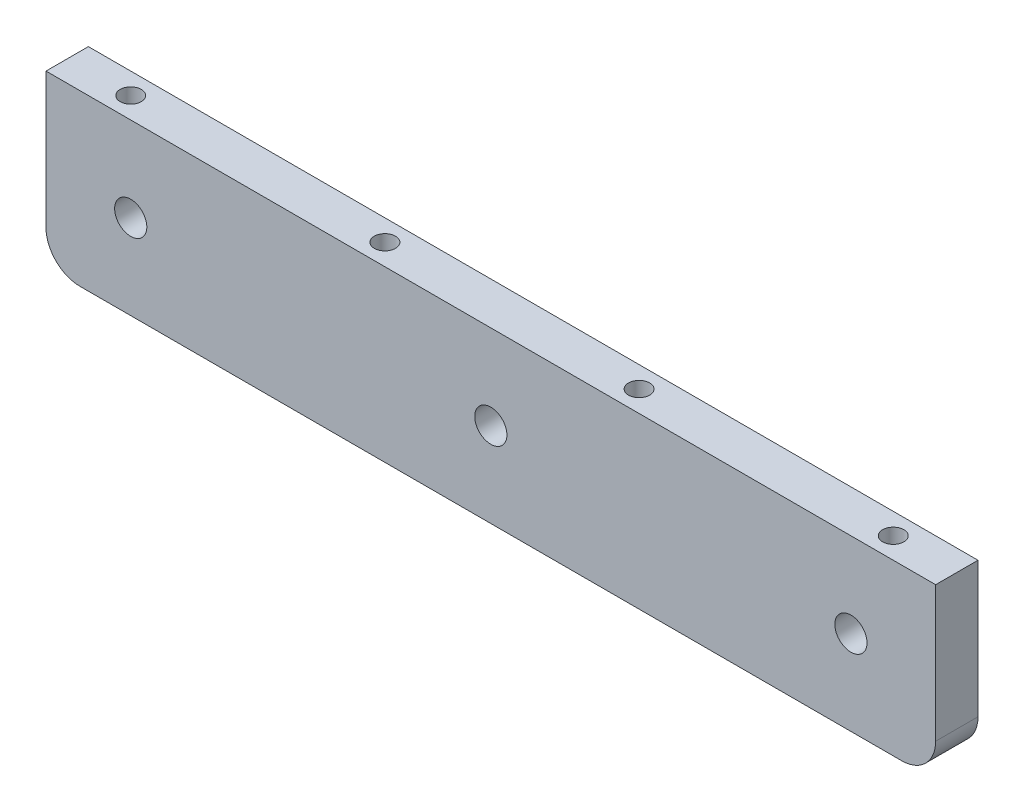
ISO-10303-21;
HEADER;
FILE_DESCRIPTION(('STEP AP214'),'2;1');
FILE_NAME('part.step','',(''),(''),'','','');
FILE_SCHEMA(('AUTOMOTIVE_DESIGN { 1 0 10303 214 1 1 1 1 }'));
ENDSEC;
DATA;
#1=APPLICATION_CONTEXT('core data for automotive mechanical design processes');
#2=APPLICATION_PROTOCOL_DEFINITION('international standard','automotive_design',2000,#1);
#3=PRODUCT_CONTEXT('',#1,'mechanical');
#4=PRODUCT('Part','Part','',(#3));
#5=PRODUCT_RELATED_PRODUCT_CATEGORY('part','',(#4));
#6=PRODUCT_DEFINITION_FORMATION('','',#4);
#7=PRODUCT_DEFINITION_CONTEXT('part definition',#1,'design');
#8=PRODUCT_DEFINITION('design','',#6,#7);
#9=PRODUCT_DEFINITION_SHAPE('','',#8);
#10=(LENGTH_UNIT() NAMED_UNIT(*) SI_UNIT(.MILLI.,.METRE.));
#11=(NAMED_UNIT(*) PLANE_ANGLE_UNIT() SI_UNIT($,.RADIAN.));
#12=(NAMED_UNIT(*) SI_UNIT($,.STERADIAN.) SOLID_ANGLE_UNIT());
#13=UNCERTAINTY_MEASURE_WITH_UNIT(LENGTH_MEASURE(1.E-05),#10,'distance_accuracy_value','');
#14=(GEOMETRIC_REPRESENTATION_CONTEXT(3) GLOBAL_UNCERTAINTY_ASSIGNED_CONTEXT((#13)) GLOBAL_UNIT_ASSIGNED_CONTEXT((#10,
#11,#12)) REPRESENTATION_CONTEXT('',''));
#15=CARTESIAN_POINT('',(0.,0.,0.));
#16=DIRECTION('',(0.,0.,1.));
#17=DIRECTION('',(1.,0.,0.));
#18=AXIS2_PLACEMENT_3D('',#15,#16,#17);
#19=CARTESIAN_POINT('',(-123.19,-40.64,6.35));
#20=DIRECTION('',(0.,0.,1.));
#21=DIRECTION('',(1.,0.,0.));
#22=AXIS2_PLACEMENT_3D('',#19,#20,#21);
#23=PLANE('',#22);
#24=CARTESIAN_POINT('',(0.,-25.4,6.35));
#25=DIRECTION('',(0.,0.,1.));
#26=DIRECTION('',(1.,0.,0.));
#27=AXIS2_PLACEMENT_3D('',#24,#25,#26);
#28=CIRCLE('',#27,4.826);
#29=CARTESIAN_POINT('',(4.826,-25.4,6.35));
#30=VERTEX_POINT('',#29);
#31=EDGE_CURVE('E255',#30,#30,#28,.T.);
#32=ORIENTED_EDGE('',*,*,#31,.F.);
#33=EDGE_LOOP('',(#32));
#34=FACE_BOUND('',#33,.T.);
#35=DIRECTION('',(0.,-1.,0.));
#36=VECTOR('',#35,1.);
#37=CARTESIAN_POINT('',(-133.35,0.,6.35));
#38=LINE('',#37,#36);
#39=CARTESIAN_POINT('',(-133.35,0.,6.35));
#40=VERTEX_POINT('',#39);
#41=CARTESIAN_POINT('',(-133.35,-40.64,6.35));
#42=VERTEX_POINT('',#41);
#43=EDGE_CURVE('E144',#40,#42,#38,.T.);
#44=ORIENTED_EDGE('',*,*,#43,.T.);
#45=CARTESIAN_POINT('',(-123.19,-40.64,6.35));
#46=DIRECTION('',(0.,0.,1.));
#47=DIRECTION('',(1.,0.,0.));
#48=AXIS2_PLACEMENT_3D('',#45,#46,#47);
#49=CIRCLE('',#48,10.16);
#50=CARTESIAN_POINT('',(-123.19,-50.8,6.35));
#51=VERTEX_POINT('',#50);
#52=EDGE_CURVE('E102',#42,#51,#49,.T.);
#53=ORIENTED_EDGE('',*,*,#52,.T.);
#54=DIRECTION('',(1.,0.,0.));
#55=VECTOR('',#54,1.);
#56=CARTESIAN_POINT('',(-123.19,-50.8,6.35));
#57=LINE('',#56,#55);
#58=CARTESIAN_POINT('',(123.19,-50.8,6.35));
#59=VERTEX_POINT('',#58);
#60=EDGE_CURVE('E115',#51,#59,#57,.T.);
#61=ORIENTED_EDGE('',*,*,#60,.T.);
#62=CARTESIAN_POINT('',(123.19,-40.64,6.35));
#63=DIRECTION('',(0.,0.,1.));
#64=DIRECTION('',(-1.,0.,0.));
#65=AXIS2_PLACEMENT_3D('',#62,#63,#64);
#66=CIRCLE('',#65,10.16);
#67=CARTESIAN_POINT('',(133.35,-40.64,6.35));
#68=VERTEX_POINT('',#67);
#69=EDGE_CURVE('E109',#59,#68,#66,.T.);
#70=ORIENTED_EDGE('',*,*,#69,.T.);
#71=DIRECTION('',(0.,1.,0.));
#72=VECTOR('',#71,1.);
#73=CARTESIAN_POINT('',(133.35,0.,6.35));
#74=LINE('',#73,#72);
#75=CARTESIAN_POINT('',(133.35,0.,6.35));
#76=VERTEX_POINT('',#75);
#77=EDGE_CURVE('E113',#68,#76,#74,.T.);
#78=ORIENTED_EDGE('',*,*,#77,.T.);
#79=DIRECTION('',(-1.,0.,0.));
#80=VECTOR('',#79,1.);
#81=CARTESIAN_POINT('',(133.35,0.,6.35));
#82=LINE('',#81,#80);
#83=EDGE_CURVE('E65',#76,#40,#82,.T.);
#84=ORIENTED_EDGE('',*,*,#83,.T.);
#85=EDGE_LOOP('',(#44,#53,#61,#70,#78,#84));
#86=FACE_BOUND('',#85,.T.);
#87=CARTESIAN_POINT('',(-107.95,-25.4,6.35));
#88=DIRECTION('',(0.,0.,1.));
#89=DIRECTION('',(1.,0.,0.));
#90=AXIS2_PLACEMENT_3D('',#87,#88,#89);
#91=CIRCLE('',#90,4.82599999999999);
#92=CARTESIAN_POINT('',(-103.124,-25.4,6.35));
#93=VERTEX_POINT('',#92);
#94=EDGE_CURVE('E137',#93,#93,#91,.T.);
#95=ORIENTED_EDGE('',*,*,#94,.F.);
#96=EDGE_LOOP('',(#95));
#97=FACE_BOUND('',#96,.T.);
#98=CARTESIAN_POINT('',(107.95,-25.4,6.35));
#99=DIRECTION('',(0.,0.,1.));
#100=DIRECTION('',(1.,0.,0.));
#101=AXIS2_PLACEMENT_3D('',#98,#99,#100);
#102=CIRCLE('',#101,4.82599999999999);
#103=CARTESIAN_POINT('',(112.776,-25.4,6.35));
#104=VERTEX_POINT('',#103);
#105=EDGE_CURVE('E249',#104,#104,#102,.T.);
#106=ORIENTED_EDGE('',*,*,#105,.F.);
#107=EDGE_LOOP('',(#106));
#108=FACE_BOUND('',#107,.T.);
#109=ADVANCED_FACE('F48',(#34,#86,#97,#108),#23,.T.);
#110=CARTESIAN_POINT('',(-123.19,-40.64,-6.35));
#111=DIRECTION('',(0.,0.,1.));
#112=DIRECTION('',(1.,0.,0.));
#113=AXIS2_PLACEMENT_3D('',#110,#111,#112);
#114=PLANE('',#113);
#115=DIRECTION('',(0.,-1.,0.));
#116=VECTOR('',#115,1.);
#117=CARTESIAN_POINT('',(-133.35,0.,-6.35));
#118=LINE('',#117,#116);
#119=CARTESIAN_POINT('',(-133.35,0.,-6.35));
#120=VERTEX_POINT('',#119);
#121=CARTESIAN_POINT('',(-133.35,-40.64,-6.35));
#122=VERTEX_POINT('',#121);
#123=EDGE_CURVE('E133',#120,#122,#118,.T.);
#124=ORIENTED_EDGE('',*,*,#123,.F.);
#125=DIRECTION('',(-1.,0.,0.));
#126=VECTOR('',#125,1.);
#127=CARTESIAN_POINT('',(133.35,0.,-6.35));
#128=LINE('',#127,#126);
#129=CARTESIAN_POINT('',(133.35,0.,-6.35));
#130=VERTEX_POINT('',#129);
#131=EDGE_CURVE('E94',#130,#120,#128,.T.);
#132=ORIENTED_EDGE('',*,*,#131,.F.);
#133=DIRECTION('',(0.,1.,0.));
#134=VECTOR('',#133,1.);
#135=CARTESIAN_POINT('',(133.35,0.,-6.35));
#136=LINE('',#135,#134);
#137=CARTESIAN_POINT('',(133.35,-40.64,-6.35));
#138=VERTEX_POINT('',#137);
#139=EDGE_CURVE('E88',#138,#130,#136,.T.);
#140=ORIENTED_EDGE('',*,*,#139,.F.);
#141=CARTESIAN_POINT('',(123.19,-40.64,-6.35));
#142=DIRECTION('',(0.,0.,1.));
#143=DIRECTION('',(-1.,0.,0.));
#144=AXIS2_PLACEMENT_3D('',#141,#142,#143);
#145=CIRCLE('',#144,10.16);
#146=CARTESIAN_POINT('',(123.19,-50.8,-6.35));
#147=VERTEX_POINT('',#146);
#148=EDGE_CURVE('E123',#147,#138,#145,.T.);
#149=ORIENTED_EDGE('',*,*,#148,.F.);
#150=DIRECTION('',(1.,0.,0.));
#151=VECTOR('',#150,1.);
#152=CARTESIAN_POINT('',(-123.19,-50.8,-6.35));
#153=LINE('',#152,#151);
#154=CARTESIAN_POINT('',(-123.19,-50.8,-6.35));
#155=VERTEX_POINT('',#154);
#156=EDGE_CURVE('E139',#155,#147,#153,.T.);
#157=ORIENTED_EDGE('',*,*,#156,.F.);
#158=CARTESIAN_POINT('',(-123.19,-40.64,-6.35));
#159=DIRECTION('',(0.,0.,1.));
#160=DIRECTION('',(1.,0.,0.));
#161=AXIS2_PLACEMENT_3D('',#158,#159,#160);
#162=CIRCLE('',#161,10.16);
#163=EDGE_CURVE('E136',#122,#155,#162,.T.);
#164=ORIENTED_EDGE('',*,*,#163,.F.);
#165=EDGE_LOOP('',(#124,#132,#140,#149,#157,#164));
#166=FACE_BOUND('',#165,.T.);
#167=CARTESIAN_POINT('',(-107.95,-25.4,-6.35));
#168=DIRECTION('',(0.,0.,1.));
#169=DIRECTION('',(1.,0.,0.));
#170=AXIS2_PLACEMENT_3D('',#167,#168,#169);
#171=CIRCLE('',#170,4.82599999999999);
#172=CARTESIAN_POINT('',(-103.124,-25.4,-6.35));
#173=VERTEX_POINT('',#172);
#174=EDGE_CURVE('E258',#173,#173,#171,.T.);
#175=ORIENTED_EDGE('',*,*,#174,.T.);
#176=EDGE_LOOP('',(#175));
#177=FACE_BOUND('',#176,.T.);
#178=CARTESIAN_POINT('',(0.,-25.4,-6.35));
#179=DIRECTION('',(0.,0.,1.));
#180=DIRECTION('',(1.,0.,0.));
#181=AXIS2_PLACEMENT_3D('',#178,#179,#180);
#182=CIRCLE('',#181,4.826);
#183=CARTESIAN_POINT('',(4.826,-25.4,-6.35));
#184=VERTEX_POINT('',#183);
#185=EDGE_CURVE('E252',#184,#184,#182,.T.);
#186=ORIENTED_EDGE('',*,*,#185,.T.);
#187=EDGE_LOOP('',(#186));
#188=FACE_BOUND('',#187,.T.);
#189=CARTESIAN_POINT('',(107.95,-25.4,-6.35));
#190=DIRECTION('',(0.,0.,1.));
#191=DIRECTION('',(1.,0.,0.));
#192=AXIS2_PLACEMENT_3D('',#189,#190,#191);
#193=CIRCLE('',#192,4.82599999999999);
#194=CARTESIAN_POINT('',(112.776,-25.4,-6.35));
#195=VERTEX_POINT('',#194);
#196=EDGE_CURVE('E247',#195,#195,#193,.T.);
#197=ORIENTED_EDGE('',*,*,#196,.T.);
#198=EDGE_LOOP('',(#197));
#199=FACE_BOUND('',#198,.T.);
#200=ADVANCED_FACE('F153',(#166,#177,#188,#199),#114,.F.);
#201=CARTESIAN_POINT('',(-133.35,0.,6.35));
#202=DIRECTION('',(1.,0.,0.));
#203=DIRECTION('',(0.,1.,0.));
#204=AXIS2_PLACEMENT_3D('',#201,#202,#203);
#205=PLANE('',#204);
#206=ORIENTED_EDGE('',*,*,#123,.T.);
#207=DIRECTION('',(0.,0.,-1.));
#208=VECTOR('',#207,1.);
#209=CARTESIAN_POINT('',(-133.35,-40.64,6.35));
#210=LINE('',#209,#208);
#211=EDGE_CURVE('E13',#42,#122,#210,.T.);
#212=ORIENTED_EDGE('',*,*,#211,.F.);
#213=ORIENTED_EDGE('',*,*,#43,.F.);
#214=DIRECTION('',(0.,0.,-1.));
#215=VECTOR('',#214,1.);
#216=CARTESIAN_POINT('',(-133.35,0.,6.35));
#217=LINE('',#216,#215);
#218=EDGE_CURVE('E129',#40,#120,#217,.T.);
#219=ORIENTED_EDGE('',*,*,#218,.T.);
#220=EDGE_LOOP('',(#206,#212,#213,#219));
#221=FACE_BOUND('',#220,.T.);
#222=ADVANCED_FACE('F50',(#221),#205,.F.);
#223=CARTESIAN_POINT('',(-123.19,-40.64,6.35));
#224=DIRECTION('',(0.,0.,-1.));
#225=DIRECTION('',(-1.,0.,0.));
#226=AXIS2_PLACEMENT_3D('',#223,#224,#225);
#227=CYLINDRICAL_SURFACE('',#226,10.16);
#228=ORIENTED_EDGE('',*,*,#163,.T.);
#229=DIRECTION('',(0.,0.,-1.));
#230=VECTOR('',#229,1.);
#231=CARTESIAN_POINT('',(-123.19,-50.8,6.35));
#232=LINE('',#231,#230);
#233=EDGE_CURVE('E57',#51,#155,#232,.T.);
#234=ORIENTED_EDGE('',*,*,#233,.F.);
#235=ORIENTED_EDGE('',*,*,#52,.F.);
#236=ORIENTED_EDGE('',*,*,#211,.T.);
#237=EDGE_LOOP('',(#228,#234,#235,#236));
#238=FACE_BOUND('',#237,.T.);
#239=ADVANCED_FACE('F353',(#238),#227,.T.);
#240=CARTESIAN_POINT('',(-123.19,-50.8,6.35));
#241=DIRECTION('',(0.,1.,0.));
#242=DIRECTION('',(0.,0.,1.));
#243=AXIS2_PLACEMENT_3D('',#240,#241,#242);
#244=PLANE('',#243);
#245=ORIENTED_EDGE('',*,*,#156,.T.);
#246=DIRECTION('',(0.,0.,-1.));
#247=VECTOR('',#246,1.);
#248=CARTESIAN_POINT('',(123.19,-50.8,6.35));
#249=LINE('',#248,#247);
#250=EDGE_CURVE('E124',#59,#147,#249,.T.);
#251=ORIENTED_EDGE('',*,*,#250,.F.);
#252=ORIENTED_EDGE('',*,*,#60,.F.);
#253=ORIENTED_EDGE('',*,*,#233,.T.);
#254=EDGE_LOOP('',(#245,#251,#252,#253));
#255=FACE_BOUND('',#254,.T.);
#256=ADVANCED_FACE('F150',(#255),#244,.F.);
#257=CARTESIAN_POINT('',(123.19,-40.64,6.35));
#258=DIRECTION('',(0.,0.,-1.));
#259=DIRECTION('',(-1.,0.,0.));
#260=AXIS2_PLACEMENT_3D('',#257,#258,#259);
#261=CYLINDRICAL_SURFACE('',#260,10.16);
#262=ORIENTED_EDGE('',*,*,#148,.T.);
#263=DIRECTION('',(0.,0.,-1.));
#264=VECTOR('',#263,1.);
#265=CARTESIAN_POINT('',(133.35,-40.64,6.35));
#266=LINE('',#265,#264);
#267=EDGE_CURVE('E120',#68,#138,#266,.T.);
#268=ORIENTED_EDGE('',*,*,#267,.F.);
#269=ORIENTED_EDGE('',*,*,#69,.F.);
#270=ORIENTED_EDGE('',*,*,#250,.T.);
#271=EDGE_LOOP('',(#262,#268,#269,#270));
#272=FACE_BOUND('',#271,.T.);
#273=ADVANCED_FACE('F121',(#272),#261,.T.);
#274=CARTESIAN_POINT('',(133.35,0.,6.35));
#275=DIRECTION('',(-1.,0.,0.));
#276=DIRECTION('',(0.,-1.,0.));
#277=AXIS2_PLACEMENT_3D('',#274,#275,#276);
#278=PLANE('',#277);
#279=ORIENTED_EDGE('',*,*,#139,.T.);
#280=DIRECTION('',(0.,0.,-1.));
#281=VECTOR('',#280,1.);
#282=CARTESIAN_POINT('',(133.35,0.,6.35));
#283=LINE('',#282,#281);
#284=EDGE_CURVE('E125',#76,#130,#283,.T.);
#285=ORIENTED_EDGE('',*,*,#284,.F.);
#286=ORIENTED_EDGE('',*,*,#77,.F.);
#287=ORIENTED_EDGE('',*,*,#267,.T.);
#288=EDGE_LOOP('',(#279,#285,#286,#287));
#289=FACE_BOUND('',#288,.T.);
#290=ADVANCED_FACE('F127',(#289),#278,.F.);
#291=CARTESIAN_POINT('',(133.35,0.,6.35));
#292=DIRECTION('',(0.,-1.,0.));
#293=DIRECTION('',(0.,0.,-1.));
#294=AXIS2_PLACEMENT_3D('',#291,#292,#293);
#295=PLANE('',#294);
#296=CARTESIAN_POINT('',(38.1,0.,0.));
#297=DIRECTION('',(0.,1.,0.));
#298=DIRECTION('',(0.,0.,1.));
#299=AXIS2_PLACEMENT_3D('',#296,#297,#298);
#300=CIRCLE('',#299,3.175);
#301=CARTESIAN_POINT('',(38.1,0.,3.175));
#302=VERTEX_POINT('',#301);
#303=EDGE_CURVE('E226',#302,#302,#300,.T.);
#304=ORIENTED_EDGE('',*,*,#303,.F.);
#305=EDGE_LOOP('',(#304));
#306=FACE_BOUND('',#305,.T.);
#307=CARTESIAN_POINT('',(-38.1,0.,2.22044604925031E-13));
#308=DIRECTION('',(0.,1.,0.));
#309=DIRECTION('',(0.,0.,-1.));
#310=AXIS2_PLACEMENT_3D('',#307,#308,#309);
#311=CIRCLE('',#310,3.17499999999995);
#312=CARTESIAN_POINT('',(-38.1,0.,3.17500000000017));
#313=VERTEX_POINT('',#312);
#314=EDGE_CURVE('E237',#313,#313,#311,.T.);
#315=ORIENTED_EDGE('',*,*,#314,.F.);
#316=EDGE_LOOP('',(#315));
#317=FACE_BOUND('',#316,.T.);
#318=CARTESIAN_POINT('',(-114.3,0.,8.88178419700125E-13));
#319=DIRECTION('',(0.,1.,0.));
#320=DIRECTION('',(0.,0.,-1.));
#321=AXIS2_PLACEMENT_3D('',#318,#319,#320);
#322=CIRCLE('',#321,3.175);
#323=CARTESIAN_POINT('',(-114.3,0.,3.17500000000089));
#324=VERTEX_POINT('',#323);
#325=EDGE_CURVE('E243',#324,#324,#322,.T.);
#326=ORIENTED_EDGE('',*,*,#325,.F.);
#327=EDGE_LOOP('',(#326));
#328=FACE_BOUND('',#327,.T.);
#329=CARTESIAN_POINT('',(114.3,0.,0.));
#330=DIRECTION('',(0.,1.,0.));
#331=DIRECTION('',(0.,0.,1.));
#332=AXIS2_PLACEMENT_3D('',#329,#330,#331);
#333=CIRCLE('',#332,3.175);
#334=CARTESIAN_POINT('',(114.3,0.,3.175));
#335=VERTEX_POINT('',#334);
#336=EDGE_CURVE('E225',#335,#335,#333,.T.);
#337=ORIENTED_EDGE('',*,*,#336,.F.);
#338=EDGE_LOOP('',(#337));
#339=FACE_BOUND('',#338,.T.);
#340=ORIENTED_EDGE('',*,*,#131,.T.);
#341=ORIENTED_EDGE('',*,*,#218,.F.);
#342=ORIENTED_EDGE('',*,*,#83,.F.);
#343=ORIENTED_EDGE('',*,*,#284,.T.);
#344=EDGE_LOOP('',(#340,#341,#342,#343));
#345=FACE_BOUND('',#344,.T.);
#346=ADVANCED_FACE('F158',(#306,#317,#328,#339,#345),#295,.F.);
#347=CARTESIAN_POINT('',(-107.95,-25.4,6.35));
#348=DIRECTION('',(0.,0.,-1.));
#349=DIRECTION('',(-1.,0.,0.));
#350=AXIS2_PLACEMENT_3D('',#347,#348,#349);
#351=CYLINDRICAL_SURFACE('',#350,4.82599999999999);
#352=ORIENTED_EDGE('',*,*,#94,.T.);
#353=EDGE_LOOP('',(#352));
#354=FACE_BOUND('',#353,.T.);
#355=ORIENTED_EDGE('',*,*,#174,.F.);
#356=EDGE_LOOP('',(#355));
#357=FACE_BOUND('',#356,.T.);
#358=ADVANCED_FACE('F160',(#354,#357),#351,.F.);
#359=CARTESIAN_POINT('',(0.,-25.4,6.35));
#360=DIRECTION('',(0.,0.,-1.));
#361=DIRECTION('',(-1.,0.,0.));
#362=AXIS2_PLACEMENT_3D('',#359,#360,#361);
#363=CYLINDRICAL_SURFACE('',#362,4.826);
#364=ORIENTED_EDGE('',*,*,#31,.T.);
#365=EDGE_LOOP('',(#364));
#366=FACE_BOUND('',#365,.T.);
#367=ORIENTED_EDGE('',*,*,#185,.F.);
#368=EDGE_LOOP('',(#367));
#369=FACE_BOUND('',#368,.T.);
#370=ADVANCED_FACE('F167',(#366,#369),#363,.F.);
#371=CARTESIAN_POINT('',(107.95,-25.4,6.35));
#372=DIRECTION('',(0.,0.,-1.));
#373=DIRECTION('',(-1.,0.,0.));
#374=AXIS2_PLACEMENT_3D('',#371,#372,#373);
#375=CYLINDRICAL_SURFACE('',#374,4.82599999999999);
#376=ORIENTED_EDGE('',*,*,#105,.T.);
#377=EDGE_LOOP('',(#376));
#378=FACE_BOUND('',#377,.T.);
#379=ORIENTED_EDGE('',*,*,#196,.F.);
#380=EDGE_LOOP('',(#379));
#381=FACE_BOUND('',#380,.T.);
#382=ADVANCED_FACE('F184',(#378,#381),#375,.F.);
#383=CARTESIAN_POINT('',(114.3,-19.05,0.));
#384=DIRECTION('',(0.,1.,0.));
#385=DIRECTION('',(0.,0.,1.));
#386=AXIS2_PLACEMENT_3D('',#383,#384,#385);
#387=CYLINDRICAL_SURFACE('',#386,3.175);
#388=CARTESIAN_POINT('',(114.3,-19.05,0.));
#389=DIRECTION('',(0.,1.,0.));
#390=DIRECTION('',(0.,0.,1.));
#391=AXIS2_PLACEMENT_3D('',#388,#389,#390);
#392=CIRCLE('',#391,3.175);
#393=CARTESIAN_POINT('',(114.3,-19.05,3.175));
#394=VERTEX_POINT('',#393);
#395=EDGE_CURVE('E229',#394,#394,#392,.T.);
#396=CARTESIAN_POINT('',(114.3,-19.05,3.175));
#397=CARTESIAN_POINT('',(114.3,-18.8515625,3.175));
#398=CARTESIAN_POINT('',(114.3,-18.653125,3.175));
#399=CARTESIAN_POINT('',(114.3,-18.25625,3.175));
#400=CARTESIAN_POINT('',(114.3,-18.0578125,3.175));
#401=CARTESIAN_POINT('',(114.3,-17.6609375,3.175));
#402=CARTESIAN_POINT('',(114.3,-17.4625,3.175));
#403=CARTESIAN_POINT('',(114.3,-17.065625,3.175));
#404=CARTESIAN_POINT('',(114.3,-16.8671875,3.175));
#405=CARTESIAN_POINT('',(114.3,-16.4703125,3.175));
#406=CARTESIAN_POINT('',(114.3,-16.271875,3.175));
#407=CARTESIAN_POINT('',(114.3,-15.875,3.175));
#408=CARTESIAN_POINT('',(114.3,-15.6765625,3.175));
#409=CARTESIAN_POINT('',(114.3,-15.2796875,3.175));
#410=CARTESIAN_POINT('',(114.3,-15.08125,3.175));
#411=CARTESIAN_POINT('',(114.3,-14.684375,3.175));
#412=CARTESIAN_POINT('',(114.3,-14.4859375,3.175));
#413=CARTESIAN_POINT('',(114.3,-14.0890625,3.175));
#414=CARTESIAN_POINT('',(114.3,-13.890625,3.175));
#415=CARTESIAN_POINT('',(114.3,-13.49375,3.175));
#416=CARTESIAN_POINT('',(114.3,-13.2953125,3.175));
#417=CARTESIAN_POINT('',(114.3,-12.8984375,3.175));
#418=CARTESIAN_POINT('',(114.3,-12.7,3.175));
#419=CARTESIAN_POINT('',(114.3,-12.303125,3.175));
#420=CARTESIAN_POINT('',(114.3,-12.1046875,3.175));
#421=CARTESIAN_POINT('',(114.3,-11.7078125,3.175));
#422=CARTESIAN_POINT('',(114.3,-11.509375,3.175));
#423=CARTESIAN_POINT('',(114.3,-11.1125,3.175));
#424=CARTESIAN_POINT('',(114.3,-10.9140625,3.175));
#425=CARTESIAN_POINT('',(114.3,-10.5171875,3.175));
#426=CARTESIAN_POINT('',(114.3,-10.31875,3.175));
#427=CARTESIAN_POINT('',(114.3,-9.921875,3.175));
#428=CARTESIAN_POINT('',(114.3,-9.7234375,3.175));
#429=CARTESIAN_POINT('',(114.3,-9.3265625,3.175));
#430=CARTESIAN_POINT('',(114.3,-9.128125,3.175));
#431=CARTESIAN_POINT('',(114.3,-8.73125,3.175));
#432=CARTESIAN_POINT('',(114.3,-8.5328125,3.175));
#433=CARTESIAN_POINT('',(114.3,-8.1359375,3.175));
#434=CARTESIAN_POINT('',(114.3,-7.9375,3.175));
#435=CARTESIAN_POINT('',(114.3,-7.540625,3.175));
#436=CARTESIAN_POINT('',(114.3,-7.3421875,3.175));
#437=CARTESIAN_POINT('',(114.3,-6.9453125,3.175));
#438=CARTESIAN_POINT('',(114.3,-6.746875,3.175));
#439=CARTESIAN_POINT('',(114.3,-6.35,3.175));
#440=CARTESIAN_POINT('',(114.3,-6.1515625,3.175));
#441=CARTESIAN_POINT('',(114.3,-5.7546875,3.175));
#442=CARTESIAN_POINT('',(114.3,-5.55625,3.175));
#443=CARTESIAN_POINT('',(114.3,-5.159375,3.175));
#444=CARTESIAN_POINT('',(114.3,-4.9609375,3.175));
#445=CARTESIAN_POINT('',(114.3,-4.5640625,3.175));
#446=CARTESIAN_POINT('',(114.3,-4.365625,3.175));
#447=CARTESIAN_POINT('',(114.3,-3.96875,3.175));
#448=CARTESIAN_POINT('',(114.3,-3.7703125,3.175));
#449=CARTESIAN_POINT('',(114.3,-3.3734375,3.175));
#450=CARTESIAN_POINT('',(114.3,-3.175,3.175));
#451=CARTESIAN_POINT('',(114.3,-2.778125,3.175));
#452=CARTESIAN_POINT('',(114.3,-2.5796875,3.175));
#453=CARTESIAN_POINT('',(114.3,-2.1828125,3.175));
#454=CARTESIAN_POINT('',(114.3,-1.984375,3.175));
#455=CARTESIAN_POINT('',(114.3,-1.5875,3.175));
#456=CARTESIAN_POINT('',(114.3,-1.3890625,3.175));
#457=CARTESIAN_POINT('',(114.3,-0.992187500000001,3.175));
#458=CARTESIAN_POINT('',(114.3,-0.793750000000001,3.175));
#459=CARTESIAN_POINT('',(114.3,-0.396875,3.175));
#460=CARTESIAN_POINT('',(114.3,-0.1984375,3.175));
#461=CARTESIAN_POINT('',(114.3,0.,3.175));
#462=B_SPLINE_CURVE_WITH_KNOTS('',3,(#396,#397,#398,#399,#400,#401,#402,#403,#404,#405,#406,
#407,#408,#409,#410,#411,#412,#413,#414,#415,#416,#417,#418,#419,#420,#421,#422,#423,#424,#425,
#426,#427,#428,#429,#430,#431,#432,#433,#434,#435,#436,#437,#438,#439,#440,#441,#442,#443,#444,
#445,#446,#447,#448,#449,#450,#451,#452,#453,#454,#455,#456,#457,#458,#459,#460,#461),
.UNSPECIFIED.,.F.,.F.,(4,2,2,2,2,2,2,2,2,2,2,2,2,2,2,2,2,2,2,2,2,2,2,2,2,2,2,2,2,2,2,2,4),(0.,
0.5953125,1.190625,1.7859375,2.38125,2.9765625,3.571875,4.1671875,4.7625,5.3578125,5.953125,
6.5484375,7.14375,7.7390625,8.334375,8.9296875,9.525,10.1203125,10.715625,11.3109375,11.90625,
12.5015625,13.096875,13.6921875,14.2875,14.8828125,15.478125,16.0734375,16.66875,17.2640625,
17.859375,18.4546875,19.05),.UNSPECIFIED.);
#463=EDGE_CURVE('BSEAM188',#394,#335,#462,.T.);
#464=ORIENTED_EDGE('',*,*,#395,.F.);
#465=ORIENTED_EDGE('',*,*,#336,.T.);
#466=ORIENTED_EDGE('',*,*,#463,.T.);
#467=ORIENTED_EDGE('',*,*,#463,.F.);
#468=EDGE_LOOP('',(#464,#466,#465,#467));
#469=FACE_BOUND('',#468,.T.);
#470=ADVANCED_FACE('F188',(#469),#387,.F.);
#471=CARTESIAN_POINT('',(114.3,-19.05,0.));
#472=DIRECTION('',(0.,1.,0.));
#473=DIRECTION('',(0.,0.,1.));
#474=AXIS2_PLACEMENT_3D('',#471,#472,#473);
#475=PLANE('',#474);
#476=ORIENTED_EDGE('',*,*,#395,.T.);
#477=EDGE_LOOP('',(#476));
#478=FACE_BOUND('',#477,.T.);
#479=ADVANCED_FACE('F192',(#478),#475,.T.);
#480=CARTESIAN_POINT('',(-114.3,-19.05,8.88178419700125E-13));
#481=DIRECTION('',(0.,1.,0.));
#482=DIRECTION('',(0.,0.,1.));
#483=AXIS2_PLACEMENT_3D('',#480,#481,#482);
#484=CYLINDRICAL_SURFACE('',#483,3.175);
#485=CARTESIAN_POINT('',(-114.3,-19.05,8.88178419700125E-13));
#486=DIRECTION('',(0.,1.,0.));
#487=DIRECTION('',(0.,0.,-1.));
#488=AXIS2_PLACEMENT_3D('',#485,#486,#487);
#489=CIRCLE('',#488,3.175);
#490=CARTESIAN_POINT('',(-114.3,-19.05,3.17500000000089));
#491=VERTEX_POINT('',#490);
#492=EDGE_CURVE('E240',#491,#491,#489,.T.);
#493=CARTESIAN_POINT('',(-114.3,-19.05,3.17500000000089));
#494=CARTESIAN_POINT('',(-114.3,-18.8515625,3.17500000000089));
#495=CARTESIAN_POINT('',(-114.3,-18.653125,3.17500000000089));
#496=CARTESIAN_POINT('',(-114.3,-18.25625,3.17500000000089));
#497=CARTESIAN_POINT('',(-114.3,-18.0578125,3.17500000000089));
#498=CARTESIAN_POINT('',(-114.3,-17.6609375,3.17500000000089));
#499=CARTESIAN_POINT('',(-114.3,-17.4625,3.17500000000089));
#500=CARTESIAN_POINT('',(-114.3,-17.065625,3.17500000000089));
#501=CARTESIAN_POINT('',(-114.3,-16.8671875,3.17500000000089));
#502=CARTESIAN_POINT('',(-114.3,-16.4703125,3.17500000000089));
#503=CARTESIAN_POINT('',(-114.3,-16.271875,3.17500000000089));
#504=CARTESIAN_POINT('',(-114.3,-15.875,3.17500000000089));
#505=CARTESIAN_POINT('',(-114.3,-15.6765625,3.17500000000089));
#506=CARTESIAN_POINT('',(-114.3,-15.2796875,3.17500000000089));
#507=CARTESIAN_POINT('',(-114.3,-15.08125,3.17500000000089));
#508=CARTESIAN_POINT('',(-114.3,-14.684375,3.17500000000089));
#509=CARTESIAN_POINT('',(-114.3,-14.4859375,3.17500000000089));
#510=CARTESIAN_POINT('',(-114.3,-14.0890625,3.17500000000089));
#511=CARTESIAN_POINT('',(-114.3,-13.890625,3.17500000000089));
#512=CARTESIAN_POINT('',(-114.3,-13.49375,3.17500000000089));
#513=CARTESIAN_POINT('',(-114.3,-13.2953125,3.17500000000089));
#514=CARTESIAN_POINT('',(-114.3,-12.8984375,3.17500000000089));
#515=CARTESIAN_POINT('',(-114.3,-12.7,3.17500000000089));
#516=CARTESIAN_POINT('',(-114.3,-12.303125,3.17500000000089));
#517=CARTESIAN_POINT('',(-114.3,-12.1046875,3.17500000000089));
#518=CARTESIAN_POINT('',(-114.3,-11.7078125,3.17500000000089));
#519=CARTESIAN_POINT('',(-114.3,-11.509375,3.17500000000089));
#520=CARTESIAN_POINT('',(-114.3,-11.1125,3.17500000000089));
#521=CARTESIAN_POINT('',(-114.3,-10.9140625,3.17500000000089));
#522=CARTESIAN_POINT('',(-114.3,-10.5171875,3.17500000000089));
#523=CARTESIAN_POINT('',(-114.3,-10.31875,3.17500000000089));
#524=CARTESIAN_POINT('',(-114.3,-9.921875,3.17500000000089));
#525=CARTESIAN_POINT('',(-114.3,-9.7234375,3.17500000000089));
#526=CARTESIAN_POINT('',(-114.3,-9.3265625,3.17500000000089));
#527=CARTESIAN_POINT('',(-114.3,-9.128125,3.17500000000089));
#528=CARTESIAN_POINT('',(-114.3,-8.73125,3.17500000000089));
#529=CARTESIAN_POINT('',(-114.3,-8.5328125,3.17500000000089));
#530=CARTESIAN_POINT('',(-114.3,-8.1359375,3.17500000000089));
#531=CARTESIAN_POINT('',(-114.3,-7.9375,3.17500000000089));
#532=CARTESIAN_POINT('',(-114.3,-7.540625,3.17500000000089));
#533=CARTESIAN_POINT('',(-114.3,-7.3421875,3.17500000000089));
#534=CARTESIAN_POINT('',(-114.3,-6.9453125,3.17500000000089));
#535=CARTESIAN_POINT('',(-114.3,-6.746875,3.17500000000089));
#536=CARTESIAN_POINT('',(-114.3,-6.35,3.17500000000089));
#537=CARTESIAN_POINT('',(-114.3,-6.1515625,3.17500000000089));
#538=CARTESIAN_POINT('',(-114.3,-5.7546875,3.17500000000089));
#539=CARTESIAN_POINT('',(-114.3,-5.55625,3.17500000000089));
#540=CARTESIAN_POINT('',(-114.3,-5.159375,3.17500000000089));
#541=CARTESIAN_POINT('',(-114.3,-4.9609375,3.17500000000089));
#542=CARTESIAN_POINT('',(-114.3,-4.5640625,3.17500000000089));
#543=CARTESIAN_POINT('',(-114.3,-4.365625,3.17500000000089));
#544=CARTESIAN_POINT('',(-114.3,-3.96875,3.17500000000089));
#545=CARTESIAN_POINT('',(-114.3,-3.7703125,3.17500000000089));
#546=CARTESIAN_POINT('',(-114.3,-3.3734375,3.17500000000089));
#547=CARTESIAN_POINT('',(-114.3,-3.175,3.17500000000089));
#548=CARTESIAN_POINT('',(-114.3,-2.778125,3.17500000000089));
#549=CARTESIAN_POINT('',(-114.3,-2.5796875,3.17500000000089));
#550=CARTESIAN_POINT('',(-114.3,-2.1828125,3.17500000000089));
#551=CARTESIAN_POINT('',(-114.3,-1.984375,3.17500000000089));
#552=CARTESIAN_POINT('',(-114.3,-1.5875,3.17500000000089));
#553=CARTESIAN_POINT('',(-114.3,-1.3890625,3.17500000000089));
#554=CARTESIAN_POINT('',(-114.3,-0.992187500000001,3.17500000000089));
#555=CARTESIAN_POINT('',(-114.3,-0.793750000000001,3.17500000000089));
#556=CARTESIAN_POINT('',(-114.3,-0.396875,3.17500000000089));
#557=CARTESIAN_POINT('',(-114.3,-0.1984375,3.17500000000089));
#558=CARTESIAN_POINT('',(-114.3,0.,3.17500000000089));
#559=B_SPLINE_CURVE_WITH_KNOTS('',3,(#493,#494,#495,#496,#497,#498,#499,#500,#501,#502,#503,
#504,#505,#506,#507,#508,#509,#510,#511,#512,#513,#514,#515,#516,#517,#518,#519,#520,#521,#522,
#523,#524,#525,#526,#527,#528,#529,#530,#531,#532,#533,#534,#535,#536,#537,#538,#539,#540,#541,
#542,#543,#544,#545,#546,#547,#548,#549,#550,#551,#552,#553,#554,#555,#556,#557,#558),
.UNSPECIFIED.,.F.,.F.,(4,2,2,2,2,2,2,2,2,2,2,2,2,2,2,2,2,2,2,2,2,2,2,2,2,2,2,2,2,2,2,2,4),(0.,
0.5953125,1.190625,1.7859375,2.38125,2.9765625,3.571875,4.1671875,4.7625,5.3578125,5.953125,
6.5484375,7.14375,7.7390625,8.334375,8.9296875,9.525,10.1203125,10.715625,11.3109375,11.90625,
12.5015625,13.096875,13.6921875,14.2875,14.8828125,15.478125,16.0734375,16.66875,17.2640625,
17.859375,18.4546875,19.05),.UNSPECIFIED.);
#560=EDGE_CURVE('BSEAM196',#491,#324,#559,.T.);
#561=ORIENTED_EDGE('',*,*,#492,.F.);
#562=ORIENTED_EDGE('',*,*,#325,.T.);
#563=ORIENTED_EDGE('',*,*,#560,.T.);
#564=ORIENTED_EDGE('',*,*,#560,.F.);
#565=EDGE_LOOP('',(#561,#563,#562,#564));
#566=FACE_BOUND('',#565,.T.);
#567=ADVANCED_FACE('F196',(#566),#484,.F.);
#568=CARTESIAN_POINT('',(-114.3,-19.05,8.88178419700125E-13));
#569=DIRECTION('',(0.,-1.,0.));
#570=DIRECTION('',(0.,0.,-1.));
#571=AXIS2_PLACEMENT_3D('',#568,#569,#570);
#572=PLANE('',#571);
#573=ORIENTED_EDGE('',*,*,#492,.T.);
#574=EDGE_LOOP('',(#573));
#575=FACE_BOUND('',#574,.T.);
#576=ADVANCED_FACE('F200',(#575),#572,.F.);
#577=CARTESIAN_POINT('',(-38.1,-19.05,2.22044604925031E-13));
#578=DIRECTION('',(0.,1.,0.));
#579=DIRECTION('',(0.,0.,1.));
#580=AXIS2_PLACEMENT_3D('',#577,#578,#579);
#581=CYLINDRICAL_SURFACE('',#580,3.17499999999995);
#582=CARTESIAN_POINT('',(-38.1,-19.05,2.22044604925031E-13));
#583=DIRECTION('',(0.,1.,0.));
#584=DIRECTION('',(0.,0.,-1.));
#585=AXIS2_PLACEMENT_3D('',#582,#583,#584);
#586=CIRCLE('',#585,3.17499999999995);
#587=CARTESIAN_POINT('',(-38.1,-19.05,3.17500000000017));
#588=VERTEX_POINT('',#587);
#589=EDGE_CURVE('E232',#588,#588,#586,.T.);
#590=CARTESIAN_POINT('',(-38.1,-19.05,3.17500000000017));
#591=CARTESIAN_POINT('',(-38.1,-18.8515625,3.17500000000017));
#592=CARTESIAN_POINT('',(-38.1,-18.653125,3.17500000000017));
#593=CARTESIAN_POINT('',(-38.1,-18.25625,3.17500000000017));
#594=CARTESIAN_POINT('',(-38.1,-18.0578125,3.17500000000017));
#595=CARTESIAN_POINT('',(-38.1,-17.6609375,3.17500000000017));
#596=CARTESIAN_POINT('',(-38.1,-17.4625,3.17500000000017));
#597=CARTESIAN_POINT('',(-38.1,-17.065625,3.17500000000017));
#598=CARTESIAN_POINT('',(-38.1,-16.8671875,3.17500000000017));
#599=CARTESIAN_POINT('',(-38.1,-16.4703125,3.17500000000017));
#600=CARTESIAN_POINT('',(-38.1,-16.271875,3.17500000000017));
#601=CARTESIAN_POINT('',(-38.1,-15.875,3.17500000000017));
#602=CARTESIAN_POINT('',(-38.1,-15.6765625,3.17500000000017));
#603=CARTESIAN_POINT('',(-38.1,-15.2796875,3.17500000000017));
#604=CARTESIAN_POINT('',(-38.1,-15.08125,3.17500000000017));
#605=CARTESIAN_POINT('',(-38.1,-14.684375,3.17500000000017));
#606=CARTESIAN_POINT('',(-38.1,-14.4859375,3.17500000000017));
#607=CARTESIAN_POINT('',(-38.1,-14.0890625,3.17500000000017));
#608=CARTESIAN_POINT('',(-38.1,-13.890625,3.17500000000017));
#609=CARTESIAN_POINT('',(-38.1,-13.49375,3.17500000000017));
#610=CARTESIAN_POINT('',(-38.1,-13.2953125,3.17500000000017));
#611=CARTESIAN_POINT('',(-38.1,-12.8984375,3.17500000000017));
#612=CARTESIAN_POINT('',(-38.1,-12.7,3.17500000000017));
#613=CARTESIAN_POINT('',(-38.1,-12.303125,3.17500000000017));
#614=CARTESIAN_POINT('',(-38.1,-12.1046875,3.17500000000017));
#615=CARTESIAN_POINT('',(-38.1,-11.7078125,3.17500000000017));
#616=CARTESIAN_POINT('',(-38.1,-11.509375,3.17500000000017));
#617=CARTESIAN_POINT('',(-38.1,-11.1125,3.17500000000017));
#618=CARTESIAN_POINT('',(-38.1,-10.9140625,3.17500000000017));
#619=CARTESIAN_POINT('',(-38.1,-10.5171875,3.17500000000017));
#620=CARTESIAN_POINT('',(-38.1,-10.31875,3.17500000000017));
#621=CARTESIAN_POINT('',(-38.1,-9.921875,3.17500000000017));
#622=CARTESIAN_POINT('',(-38.1,-9.7234375,3.17500000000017));
#623=CARTESIAN_POINT('',(-38.1,-9.3265625,3.17500000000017));
#624=CARTESIAN_POINT('',(-38.1,-9.128125,3.17500000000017));
#625=CARTESIAN_POINT('',(-38.1,-8.73125,3.17500000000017));
#626=CARTESIAN_POINT('',(-38.1,-8.5328125,3.17500000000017));
#627=CARTESIAN_POINT('',(-38.1,-8.1359375,3.17500000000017));
#628=CARTESIAN_POINT('',(-38.1,-7.9375,3.17500000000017));
#629=CARTESIAN_POINT('',(-38.1,-7.540625,3.17500000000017));
#630=CARTESIAN_POINT('',(-38.1,-7.3421875,3.17500000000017));
#631=CARTESIAN_POINT('',(-38.1,-6.9453125,3.17500000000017));
#632=CARTESIAN_POINT('',(-38.1,-6.746875,3.17500000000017));
#633=CARTESIAN_POINT('',(-38.1,-6.35,3.17500000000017));
#634=CARTESIAN_POINT('',(-38.1,-6.1515625,3.17500000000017));
#635=CARTESIAN_POINT('',(-38.1,-5.7546875,3.17500000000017));
#636=CARTESIAN_POINT('',(-38.1,-5.55625,3.17500000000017));
#637=CARTESIAN_POINT('',(-38.1,-5.159375,3.17500000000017));
#638=CARTESIAN_POINT('',(-38.1,-4.9609375,3.17500000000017));
#639=CARTESIAN_POINT('',(-38.1,-4.5640625,3.17500000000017));
#640=CARTESIAN_POINT('',(-38.1,-4.365625,3.17500000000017));
#641=CARTESIAN_POINT('',(-38.1,-3.96875,3.17500000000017));
#642=CARTESIAN_POINT('',(-38.1,-3.7703125,3.17500000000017));
#643=CARTESIAN_POINT('',(-38.1,-3.3734375,3.17500000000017));
#644=CARTESIAN_POINT('',(-38.1,-3.175,3.17500000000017));
#645=CARTESIAN_POINT('',(-38.1,-2.778125,3.17500000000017));
#646=CARTESIAN_POINT('',(-38.1,-2.5796875,3.17500000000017));
#647=CARTESIAN_POINT('',(-38.1,-2.1828125,3.17500000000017));
#648=CARTESIAN_POINT('',(-38.1,-1.984375,3.17500000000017));
#649=CARTESIAN_POINT('',(-38.1,-1.5875,3.17500000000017));
#650=CARTESIAN_POINT('',(-38.1,-1.3890625,3.17500000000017));
#651=CARTESIAN_POINT('',(-38.1,-0.992187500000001,3.17500000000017));
#652=CARTESIAN_POINT('',(-38.1,-0.793750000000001,3.17500000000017));
#653=CARTESIAN_POINT('',(-38.1,-0.396875,3.17500000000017));
#654=CARTESIAN_POINT('',(-38.1,-0.1984375,3.17500000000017));
#655=CARTESIAN_POINT('',(-38.1,0.,3.17500000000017));
#656=B_SPLINE_CURVE_WITH_KNOTS('',3,(#590,#591,#592,#593,#594,#595,#596,#597,#598,#599,#600,
#601,#602,#603,#604,#605,#606,#607,#608,#609,#610,#611,#612,#613,#614,#615,#616,#617,#618,#619,
#620,#621,#622,#623,#624,#625,#626,#627,#628,#629,#630,#631,#632,#633,#634,#635,#636,#637,#638,
#639,#640,#641,#642,#643,#644,#645,#646,#647,#648,#649,#650,#651,#652,#653,#654,#655),
.UNSPECIFIED.,.F.,.F.,(4,2,2,2,2,2,2,2,2,2,2,2,2,2,2,2,2,2,2,2,2,2,2,2,2,2,2,2,2,2,2,2,4),(0.,
0.5953125,1.190625,1.7859375,2.38125,2.9765625,3.571875,4.1671875,4.7625,5.3578125,5.953125,
6.5484375,7.14375,7.7390625,8.334375,8.9296875,9.525,10.1203125,10.715625,11.3109375,11.90625,
12.5015625,13.096875,13.6921875,14.2875,14.8828125,15.478125,16.0734375,16.66875,17.2640625,
17.859375,18.4546875,19.05),.UNSPECIFIED.);
#657=EDGE_CURVE('BSEAM204',#588,#313,#656,.T.);
#658=ORIENTED_EDGE('',*,*,#589,.F.);
#659=ORIENTED_EDGE('',*,*,#314,.T.);
#660=ORIENTED_EDGE('',*,*,#657,.T.);
#661=ORIENTED_EDGE('',*,*,#657,.F.);
#662=EDGE_LOOP('',(#658,#660,#659,#661));
#663=FACE_BOUND('',#662,.T.);
#664=ADVANCED_FACE('F204',(#663),#581,.F.);
#665=CARTESIAN_POINT('',(-38.1,-19.05,2.22044604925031E-13));
#666=DIRECTION('',(0.,-1.,0.));
#667=DIRECTION('',(0.,0.,-1.));
#668=AXIS2_PLACEMENT_3D('',#665,#666,#667);
#669=PLANE('',#668);
#670=ORIENTED_EDGE('',*,*,#589,.T.);
#671=EDGE_LOOP('',(#670));
#672=FACE_BOUND('',#671,.T.);
#673=ADVANCED_FACE('F208',(#672),#669,.F.);
#674=CARTESIAN_POINT('',(38.1,-19.05,0.));
#675=DIRECTION('',(0.,1.,0.));
#676=DIRECTION('',(0.,0.,1.));
#677=AXIS2_PLACEMENT_3D('',#674,#675,#676);
#678=CYLINDRICAL_SURFACE('',#677,3.175);
#679=CARTESIAN_POINT('',(38.1,-19.05,0.));
#680=DIRECTION('',(0.,1.,0.));
#681=DIRECTION('',(0.,0.,1.));
#682=AXIS2_PLACEMENT_3D('',#679,#680,#681);
#683=CIRCLE('',#682,3.175);
#684=CARTESIAN_POINT('',(38.1,-19.05,3.175));
#685=VERTEX_POINT('',#684);
#686=EDGE_CURVE('E224',#685,#685,#683,.T.);
#687=CARTESIAN_POINT('',(38.1,-19.05,3.175));
#688=CARTESIAN_POINT('',(38.1,-18.8515625,3.175));
#689=CARTESIAN_POINT('',(38.1,-18.653125,3.175));
#690=CARTESIAN_POINT('',(38.1,-18.25625,3.175));
#691=CARTESIAN_POINT('',(38.1,-18.0578125,3.175));
#692=CARTESIAN_POINT('',(38.1,-17.6609375,3.175));
#693=CARTESIAN_POINT('',(38.1,-17.4625,3.175));
#694=CARTESIAN_POINT('',(38.1,-17.065625,3.175));
#695=CARTESIAN_POINT('',(38.1,-16.8671875,3.175));
#696=CARTESIAN_POINT('',(38.1,-16.4703125,3.175));
#697=CARTESIAN_POINT('',(38.1,-16.271875,3.175));
#698=CARTESIAN_POINT('',(38.1,-15.875,3.175));
#699=CARTESIAN_POINT('',(38.1,-15.6765625,3.175));
#700=CARTESIAN_POINT('',(38.1,-15.2796875,3.175));
#701=CARTESIAN_POINT('',(38.1,-15.08125,3.175));
#702=CARTESIAN_POINT('',(38.1,-14.684375,3.175));
#703=CARTESIAN_POINT('',(38.1,-14.4859375,3.175));
#704=CARTESIAN_POINT('',(38.1,-14.0890625,3.175));
#705=CARTESIAN_POINT('',(38.1,-13.890625,3.175));
#706=CARTESIAN_POINT('',(38.1,-13.49375,3.175));
#707=CARTESIAN_POINT('',(38.1,-13.2953125,3.175));
#708=CARTESIAN_POINT('',(38.1,-12.8984375,3.175));
#709=CARTESIAN_POINT('',(38.1,-12.7,3.175));
#710=CARTESIAN_POINT('',(38.1,-12.303125,3.175));
#711=CARTESIAN_POINT('',(38.1,-12.1046875,3.175));
#712=CARTESIAN_POINT('',(38.1,-11.7078125,3.175));
#713=CARTESIAN_POINT('',(38.1,-11.509375,3.175));
#714=CARTESIAN_POINT('',(38.1,-11.1125,3.175));
#715=CARTESIAN_POINT('',(38.1,-10.9140625,3.175));
#716=CARTESIAN_POINT('',(38.1,-10.5171875,3.175));
#717=CARTESIAN_POINT('',(38.1,-10.31875,3.175));
#718=CARTESIAN_POINT('',(38.1,-9.921875,3.175));
#719=CARTESIAN_POINT('',(38.1,-9.7234375,3.175));
#720=CARTESIAN_POINT('',(38.1,-9.3265625,3.175));
#721=CARTESIAN_POINT('',(38.1,-9.128125,3.175));
#722=CARTESIAN_POINT('',(38.1,-8.73125,3.175));
#723=CARTESIAN_POINT('',(38.1,-8.5328125,3.175));
#724=CARTESIAN_POINT('',(38.1,-8.1359375,3.175));
#725=CARTESIAN_POINT('',(38.1,-7.9375,3.175));
#726=CARTESIAN_POINT('',(38.1,-7.540625,3.175));
#727=CARTESIAN_POINT('',(38.1,-7.3421875,3.175));
#728=CARTESIAN_POINT('',(38.1,-6.9453125,3.175));
#729=CARTESIAN_POINT('',(38.1,-6.746875,3.175));
#730=CARTESIAN_POINT('',(38.1,-6.35,3.175));
#731=CARTESIAN_POINT('',(38.1,-6.1515625,3.175));
#732=CARTESIAN_POINT('',(38.1,-5.7546875,3.175));
#733=CARTESIAN_POINT('',(38.1,-5.55625,3.175));
#734=CARTESIAN_POINT('',(38.1,-5.159375,3.175));
#735=CARTESIAN_POINT('',(38.1,-4.9609375,3.175));
#736=CARTESIAN_POINT('',(38.1,-4.5640625,3.175));
#737=CARTESIAN_POINT('',(38.1,-4.365625,3.175));
#738=CARTESIAN_POINT('',(38.1,-3.96875,3.175));
#739=CARTESIAN_POINT('',(38.1,-3.7703125,3.175));
#740=CARTESIAN_POINT('',(38.1,-3.3734375,3.175));
#741=CARTESIAN_POINT('',(38.1,-3.175,3.175));
#742=CARTESIAN_POINT('',(38.1,-2.778125,3.175));
#743=CARTESIAN_POINT('',(38.1,-2.5796875,3.175));
#744=CARTESIAN_POINT('',(38.1,-2.1828125,3.175));
#745=CARTESIAN_POINT('',(38.1,-1.984375,3.175));
#746=CARTESIAN_POINT('',(38.1,-1.5875,3.175));
#747=CARTESIAN_POINT('',(38.1,-1.3890625,3.175));
#748=CARTESIAN_POINT('',(38.1,-0.992187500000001,3.175));
#749=CARTESIAN_POINT('',(38.1,-0.793750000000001,3.175));
#750=CARTESIAN_POINT('',(38.1,-0.396875,3.175));
#751=CARTESIAN_POINT('',(38.1,-0.1984375,3.175));
#752=CARTESIAN_POINT('',(38.1,0.,3.175));
#753=B_SPLINE_CURVE_WITH_KNOTS('',3,(#687,#688,#689,#690,#691,#692,#693,#694,#695,#696,#697,
#698,#699,#700,#701,#702,#703,#704,#705,#706,#707,#708,#709,#710,#711,#712,#713,#714,#715,#716,
#717,#718,#719,#720,#721,#722,#723,#724,#725,#726,#727,#728,#729,#730,#731,#732,#733,#734,#735,
#736,#737,#738,#739,#740,#741,#742,#743,#744,#745,#746,#747,#748,#749,#750,#751,#752),
.UNSPECIFIED.,.F.,.F.,(4,2,2,2,2,2,2,2,2,2,2,2,2,2,2,2,2,2,2,2,2,2,2,2,2,2,2,2,2,2,2,2,4),(0.,
0.5953125,1.190625,1.7859375,2.38125,2.9765625,3.571875,4.1671875,4.7625,5.3578125,5.953125,
6.5484375,7.14375,7.7390625,8.334375,8.9296875,9.525,10.1203125,10.715625,11.3109375,11.90625,
12.5015625,13.096875,13.6921875,14.2875,14.8828125,15.478125,16.0734375,16.66875,17.2640625,
17.859375,18.4546875,19.05),.UNSPECIFIED.);
#754=EDGE_CURVE('BSEAM212',#685,#302,#753,.T.);
#755=ORIENTED_EDGE('',*,*,#686,.F.);
#756=ORIENTED_EDGE('',*,*,#303,.T.);
#757=ORIENTED_EDGE('',*,*,#754,.T.);
#758=ORIENTED_EDGE('',*,*,#754,.F.);
#759=EDGE_LOOP('',(#755,#757,#756,#758));
#760=FACE_BOUND('',#759,.T.);
#761=ADVANCED_FACE('F212',(#760),#678,.F.);
#762=CARTESIAN_POINT('',(38.1,-19.05,0.));
#763=DIRECTION('',(0.,1.,0.));
#764=DIRECTION('',(0.,0.,1.));
#765=AXIS2_PLACEMENT_3D('',#762,#763,#764);
#766=PLANE('',#765);
#767=ORIENTED_EDGE('',*,*,#686,.T.);
#768=EDGE_LOOP('',(#767));
#769=FACE_BOUND('',#768,.T.);
#770=ADVANCED_FACE('F216',(#769),#766,.T.);
#771=CLOSED_SHELL('',(#109,#200,#222,#239,#256,#273,#290,#346,#358,#370,#382,#470,#479,#567,
#576,#664,#673,#761,#770));
#772=MANIFOLD_SOLID_BREP('B2',#771);
#773=ADVANCED_BREP_SHAPE_REPRESENTATION('',(#18,#772),#14);
#774=SHAPE_DEFINITION_REPRESENTATION(#9,#773);
ENDSEC;
END-ISO-10303-21;
